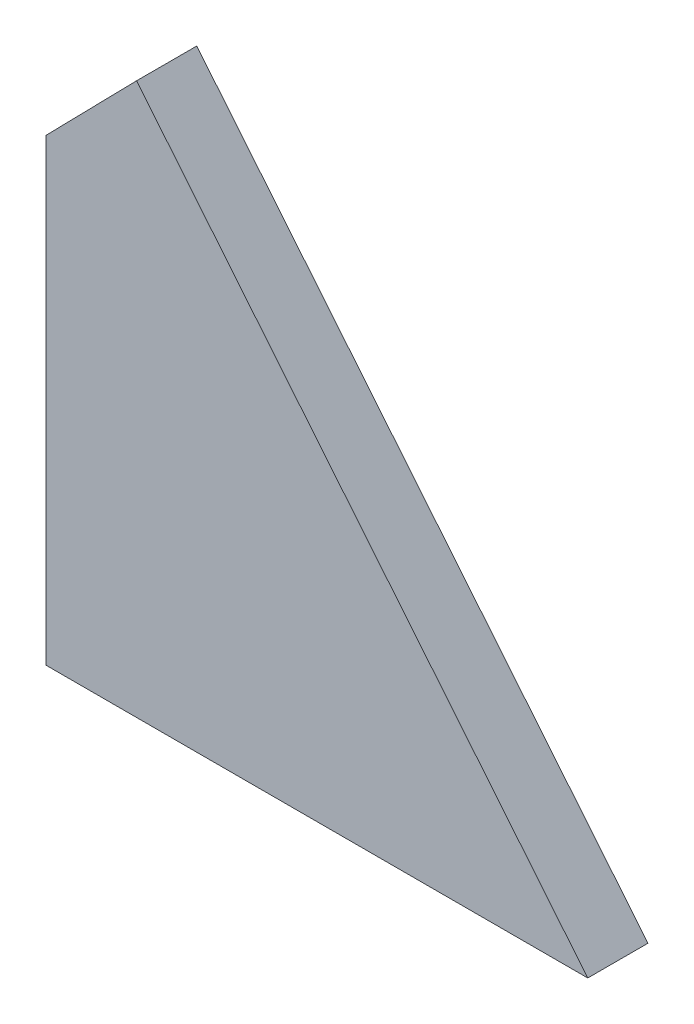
ISO-10303-21;
HEADER;
FILE_DESCRIPTION(('STEP AP214'),'2;1');
FILE_NAME('part.step','',(''),(''),'','','');
FILE_SCHEMA(('AUTOMOTIVE_DESIGN { 1 0 10303 214 1 1 1 1 }'));
ENDSEC;
DATA;
#1=APPLICATION_CONTEXT('core data for automotive mechanical design processes');
#2=APPLICATION_PROTOCOL_DEFINITION('international standard','automotive_design',2000,#1);
#3=PRODUCT_CONTEXT('',#1,'mechanical');
#4=PRODUCT('Part','Part','',(#3));
#5=PRODUCT_RELATED_PRODUCT_CATEGORY('part','',(#4));
#6=PRODUCT_DEFINITION_FORMATION('','',#4);
#7=PRODUCT_DEFINITION_CONTEXT('part definition',#1,'design');
#8=PRODUCT_DEFINITION('design','',#6,#7);
#9=PRODUCT_DEFINITION_SHAPE('','',#8);
#10=(LENGTH_UNIT() NAMED_UNIT(*) SI_UNIT(.MILLI.,.METRE.));
#11=(NAMED_UNIT(*) PLANE_ANGLE_UNIT() SI_UNIT($,.RADIAN.));
#12=(NAMED_UNIT(*) SI_UNIT($,.STERADIAN.) SOLID_ANGLE_UNIT());
#13=UNCERTAINTY_MEASURE_WITH_UNIT(LENGTH_MEASURE(1.E-05),#10,'distance_accuracy_value','');
#14=(GEOMETRIC_REPRESENTATION_CONTEXT(3) GLOBAL_UNCERTAINTY_ASSIGNED_CONTEXT((#13)) GLOBAL_UNIT_ASSIGNED_CONTEXT((#10,
#11,#12)) REPRESENTATION_CONTEXT('',''));
#15=CARTESIAN_POINT('',(0.,0.,0.));
#16=DIRECTION('',(0.,0.,1.));
#17=DIRECTION('',(1.,0.,0.));
#18=AXIS2_PLACEMENT_3D('',#15,#16,#17);
#19=CARTESIAN_POINT('',(72.,0.,8.));
#20=DIRECTION('',(0.,1.,0.));
#21=DIRECTION('',(-1.,0.,0.));
#22=AXIS2_PLACEMENT_3D('',#19,#20,#21);
#23=PLANE('',#22);
#24=DIRECTION('',(1.,0.,0.));
#25=VECTOR('',#24,1.);
#26=CARTESIAN_POINT('',(72.,0.,0.));
#27=LINE('',#26,#25);
#28=CARTESIAN_POINT('',(0.,0.,0.));
#29=VERTEX_POINT('',#28);
#30=CARTESIAN_POINT('',(72.,0.,0.));
#31=VERTEX_POINT('',#30);
#32=EDGE_CURVE('E82',#29,#31,#27,.T.);
#33=ORIENTED_EDGE('',*,*,#32,.T.);
#34=DIRECTION('',(0.,0.,-1.));
#35=VECTOR('',#34,1.);
#36=CARTESIAN_POINT('',(72.,0.,8.));
#37=LINE('',#36,#35);
#38=CARTESIAN_POINT('',(72.,0.,8.));
#39=VERTEX_POINT('',#38);
#40=EDGE_CURVE('E11',#39,#31,#37,.T.);
#41=ORIENTED_EDGE('',*,*,#40,.F.);
#42=DIRECTION('',(1.,0.,0.));
#43=VECTOR('',#42,1.);
#44=CARTESIAN_POINT('',(72.,0.,8.));
#45=LINE('',#44,#43);
#46=CARTESIAN_POINT('',(0.,0.,8.));
#47=VERTEX_POINT('',#46);
#48=EDGE_CURVE('E76',#47,#39,#45,.T.);
#49=ORIENTED_EDGE('',*,*,#48,.F.);
#50=DIRECTION('',(0.,0.,-1.));
#51=VECTOR('',#50,1.);
#52=CARTESIAN_POINT('',(0.,0.,8.));
#53=LINE('',#52,#51);
#54=EDGE_CURVE('E38',#47,#29,#53,.T.);
#55=ORIENTED_EDGE('',*,*,#54,.T.);
#56=EDGE_LOOP('',(#33,#41,#49,#55));
#57=FACE_BOUND('',#56,.T.);
#58=ADVANCED_FACE('F31',(#57),#23,.F.);
#59=CARTESIAN_POINT('',(0.,88.,8.));
#60=DIRECTION('',(-0.773957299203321,-0.633237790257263,0.));
#61=DIRECTION('',(0.633237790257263,-0.773957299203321,0.));
#62=AXIS2_PLACEMENT_3D('',#59,#60,#61);
#63=PLANE('',#62);
#64=DIRECTION('',(-0.633237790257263,0.773957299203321,0.));
#65=VECTOR('',#64,1.);
#66=CARTESIAN_POINT('',(0.,88.,0.));
#67=LINE('',#66,#65);
#68=CARTESIAN_POINT('',(12.031518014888,73.2948113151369,0.));
#69=VERTEX_POINT('',#68);
#70=EDGE_CURVE('E77',#31,#69,#67,.T.);
#71=ORIENTED_EDGE('',*,*,#70,.T.);
#72=DIRECTION('',(0.,0.,1.));
#73=VECTOR('',#72,1.);
#74=CARTESIAN_POINT('',(12.031518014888,73.2948113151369,0.));
#75=LINE('',#74,#73);
#76=CARTESIAN_POINT('',(12.031518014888,73.2948113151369,8.));
#77=VERTEX_POINT('',#76);
#78=EDGE_CURVE('E45',#69,#77,#75,.T.);
#79=ORIENTED_EDGE('',*,*,#78,.T.);
#80=DIRECTION('',(-0.633237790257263,0.773957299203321,0.));
#81=VECTOR('',#80,1.);
#82=CARTESIAN_POINT('',(0.,88.,8.));
#83=LINE('',#82,#81);
#84=EDGE_CURVE('E90',#39,#77,#83,.T.);
#85=ORIENTED_EDGE('',*,*,#84,.F.);
#86=ORIENTED_EDGE('',*,*,#40,.T.);
#87=EDGE_LOOP('',(#71,#79,#85,#86));
#88=FACE_BOUND('',#87,.T.);
#89=ADVANCED_FACE('F99',(#88),#63,.F.);
#90=CARTESIAN_POINT('',(0.,0.,8.));
#91=DIRECTION('',(1.,0.,0.));
#92=DIRECTION('',(0.,0.,-1.));
#93=AXIS2_PLACEMENT_3D('',#90,#91,#92);
#94=PLANE('',#93);
#95=DIRECTION('',(0.,-1.,0.));
#96=VECTOR('',#95,1.);
#97=CARTESIAN_POINT('',(0.,0.,8.));
#98=LINE('',#97,#96);
#99=CARTESIAN_POINT('',(0.,61.,8.));
#100=VERTEX_POINT('',#99);
#101=EDGE_CURVE('E54',#100,#47,#98,.T.);
#102=ORIENTED_EDGE('',*,*,#101,.F.);
#103=DIRECTION('',(0.,0.,1.));
#104=VECTOR('',#103,1.);
#105=CARTESIAN_POINT('',(0.,61.,0.));
#106=LINE('',#105,#104);
#107=CARTESIAN_POINT('',(0.,61.,0.));
#108=VERTEX_POINT('',#107);
#109=EDGE_CURVE('E73',#108,#100,#106,.T.);
#110=ORIENTED_EDGE('',*,*,#109,.F.);
#111=DIRECTION('',(0.,-1.,0.));
#112=VECTOR('',#111,1.);
#113=CARTESIAN_POINT('',(0.,0.,0.));
#114=LINE('',#113,#112);
#115=EDGE_CURVE('E68',#108,#29,#114,.T.);
#116=ORIENTED_EDGE('',*,*,#115,.T.);
#117=ORIENTED_EDGE('',*,*,#54,.F.);
#118=EDGE_LOOP('',(#102,#110,#116,#117));
#119=FACE_BOUND('',#118,.T.);
#120=ADVANCED_FACE('F70',(#119),#94,.F.);
#121=CARTESIAN_POINT('',(0.,0.,8.));
#122=DIRECTION('',(0.,0.,-1.));
#123=DIRECTION('',(-1.,0.,0.));
#124=AXIS2_PLACEMENT_3D('',#121,#122,#123);
#125=PLANE('',#124);
#126=ORIENTED_EDGE('',*,*,#84,.T.);
#127=DIRECTION('',(0.699412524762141,0.714718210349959,0.));
#128=VECTOR('',#127,1.);
#129=CARTESIAN_POINT('',(0.,61.,8.));
#130=LINE('',#129,#128);
#131=EDGE_CURVE('E96',#100,#77,#130,.T.);
#132=ORIENTED_EDGE('',*,*,#131,.F.);
#133=ORIENTED_EDGE('',*,*,#101,.T.);
#134=ORIENTED_EDGE('',*,*,#48,.T.);
#135=EDGE_LOOP('',(#126,#132,#133,#134));
#136=FACE_BOUND('',#135,.T.);
#137=ADVANCED_FACE('F101',(#136),#125,.F.);
#138=CARTESIAN_POINT('',(0.,0.,0.));
#139=DIRECTION('',(0.,0.,-1.));
#140=DIRECTION('',(-1.,0.,0.));
#141=AXIS2_PLACEMENT_3D('',#138,#139,#140);
#142=PLANE('',#141);
#143=DIRECTION('',(0.699412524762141,0.714718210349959,0.));
#144=VECTOR('',#143,1.);
#145=CARTESIAN_POINT('',(0.,61.,0.));
#146=LINE('',#145,#144);
#147=EDGE_CURVE('E94',#108,#69,#146,.T.);
#148=ORIENTED_EDGE('',*,*,#147,.T.);
#149=ORIENTED_EDGE('',*,*,#70,.F.);
#150=ORIENTED_EDGE('',*,*,#32,.F.);
#151=ORIENTED_EDGE('',*,*,#115,.F.);
#152=EDGE_LOOP('',(#148,#149,#150,#151));
#153=FACE_BOUND('',#152,.T.);
#154=ADVANCED_FACE('F83',(#153),#142,.T.);
#155=CARTESIAN_POINT('',(0.,61.,0.));
#156=DIRECTION('',(0.714718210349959,-0.699412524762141,0.));
#157=DIRECTION('',(0.699412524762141,0.714718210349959,0.));
#158=AXIS2_PLACEMENT_3D('',#155,#156,#157);
#159=PLANE('',#158);
#160=ORIENTED_EDGE('',*,*,#131,.T.);
#161=ORIENTED_EDGE('',*,*,#78,.F.);
#162=ORIENTED_EDGE('',*,*,#147,.F.);
#163=ORIENTED_EDGE('',*,*,#109,.T.);
#164=EDGE_LOOP('',(#160,#161,#162,#163));
#165=FACE_BOUND('',#164,.T.);
#166=ADVANCED_FACE('F108',(#165),#159,.F.);
#167=CLOSED_SHELL('',(#58,#89,#120,#137,#154,#166));
#168=MANIFOLD_SOLID_BREP('B2',#167);
#169=ADVANCED_BREP_SHAPE_REPRESENTATION('',(#18,#168),#14);
#170=SHAPE_DEFINITION_REPRESENTATION(#9,#169);
ENDSEC;
END-ISO-10303-21;
